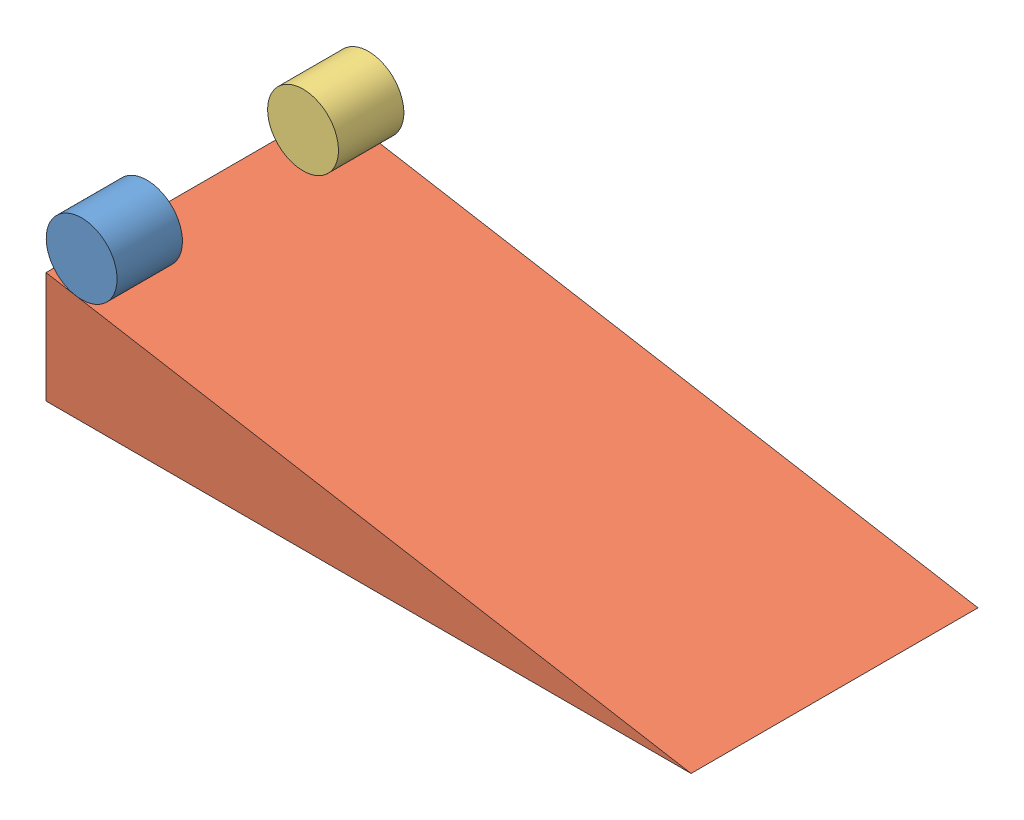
SolidWorks assembly cylindresPlateauMasseDifferente.SLDASM, configuration Défaut (file format 8000). Lengths in mm.
Overall size (594.59 171.82 259).
3 component instances, 3 part files, 7 mates.
Components (placement in the parent):
- cylindre-1: cylindre.SLDPRT [Défaut] at (-70.0696 40.422 68.3604) x (0.82386 -0.566793 0) z (0 0 1) size (63.97 63.97 59)
- plateau-1: plateau.SLDPRT [Défaut] at (39.7068 -59.7282 27.3604) size (582.29 100.44 259)
- cylindre2-1: cylindre2.SLDPRT [Défaut] at (-70.2205 41.0203 -131.6396) size (63.97 63.97 59)
Mates (geometry in assembly coordinates):
- Coïncidente1: coincident aligned: plane of cylindre-1 through (-70.0696 40.422 127.3604) normal (0 0 1); plane of plateau-1 through (39.7068 -59.7282 127.3604) normal (0 0 1)
- Tangent1: tangent anti-aligned: cylinder of cylindre-1 through (-70.0696 40.422 127.3604) axis (0 0 -1) radius 31.9829; plane of plateau-1 through (-102.2474 13.5172 -131.6396) normal (0.169979 0.985448 0)
- Coïncidente2: coincident aligned: plane of cylindre-1 through (-70.0696 40.422 127.3604) normal (0 0 1); plane of plateau-1 through (39.7068 -59.7282 127.3604) normal (0 0 1)
- Tangent2: tangent anti-aligned: cylinder of cylindre-1 through (-70.0696 40.422 127.3604) axis (0 0 -1) radius 31.9829; plane of plateau-1 through (-102.2474 13.5172 -131.6396) normal (0.169979 0.985448 0)
- Tangent3: tangent anti-aligned: plane of plateau-1 through (-102.2474 13.5172 -131.6396) normal (0.169979 0.985448 0); cylinder of cylindre2-1 through (-70.3163 40.4646 -72.6396) axis (0 0 -1) radius 31.9829
- Parallèle1: parallel aligned: plane of cylindre-1 through (-70.0696 40.422 127.3604) normal (0 0 1); plane of plateau-1 through (39.7068 -59.7282 127.3604) normal (0 0 1)
- Parallèle2: parallel aligned: plane of plateau-1 through (39.7068 -59.7282 127.3604) normal (0 0 1); plane of cylindre2-1 through (-70.3163 40.4646 -72.6396) normal (0 0 1)
